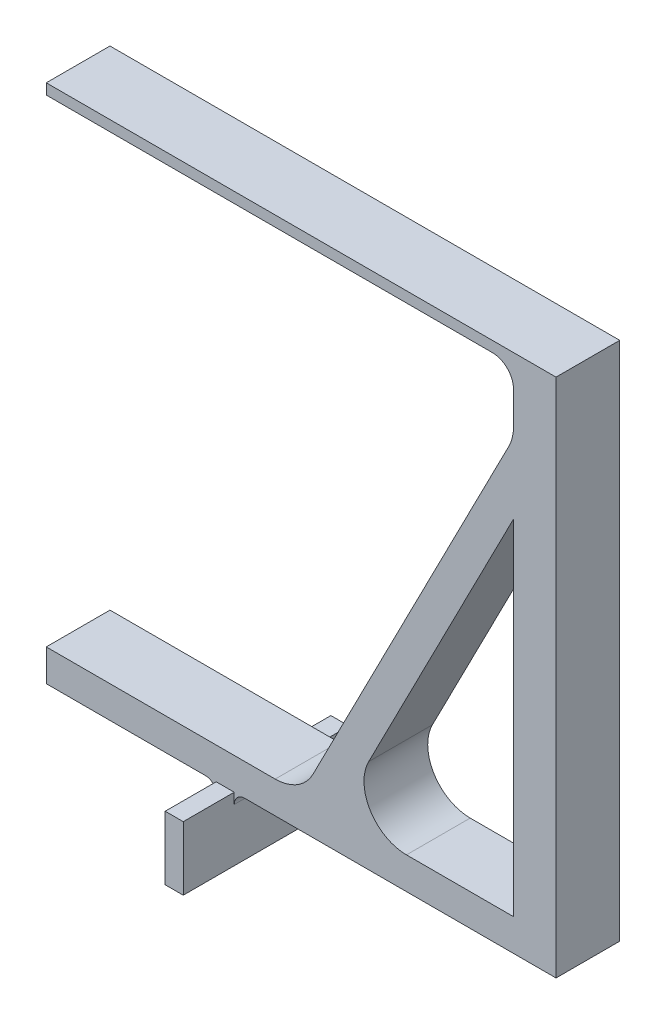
from build123d import *

# Parameters (mm, degrees)
BOSS_EXTRUDE1_DEPTH      = 3
FILLET1_R                = 2
FILLET2_R                = 1
BOSS_EXTRUDE2_DEPTH      = 2.4
BOSS_EXTRUDE2_DEPTH_BACK = 5.4
SKETCH2_W                = 0.85
SKETCH2_H                = 3
FILLET3_R                = 0.5
SKETCH3_W                = 3
SKETCH3_H                = 1.5
BOSS_EXTRUDE3_DEPTH      = 4


with BuildPart() as part:
    # Sketch1 → Boss-Extrude1 (new body)
    with BuildSketch(Plane.XY):
        Polygon((0, 3), (0, 0), (0.85, 0), (0.85, 3), (16, 3), (16, 27.5), (14, 27.5), (-8, 27.5), (-8, 27), (14, 27), (14, 24), (4, 4.5), (-4, 4.5), (-4, 3), align=None)
        Polygon((14, 4.5), (14, 20.71280895), (5.685739, 4.5), align=None, mode=Mode.SUBTRACT)
    extrude(amount=BOSS_EXTRUDE1_DEPTH)

    # Fillet1
    fillet1_edges = [part.edges().sort_by_distance(p)[0] for p in [
        (4, 4.5, 1.5),
        (14, 24, 1.5),
        (5.685739, 4.5, 1.5),
    ]]
    fillet(fillet1_edges, radius=FILLET1_R)

    # Fillet2
    fillet2_edges = [part.edges().sort_by_distance(p)[0] for p in [
        (14, 27, 1.5),
    ]]
    fillet(fillet2_edges, radius=FILLET2_R)

    # Sketch2 → Boss-Extrude2 (add, two sides: drawn at the far end of the back side and taken through both)
    with BuildSketch(Plane.XY.offset(3).offset(-BOSS_EXTRUDE2_DEPTH_BACK)):
        with Locations((0.425, 1.5)):
            Rectangle(SKETCH2_W, SKETCH2_H)
    extrude(amount=BOSS_EXTRUDE2_DEPTH + BOSS_EXTRUDE2_DEPTH_BACK)

    # Fillet3
    fillet3_edges = [part.edges().sort_by_distance(p)[0] for p in [
        (0, 3, 1.5),
        (0.85, 3, 1.5),
    ]]
    fillet(fillet3_edges, radius=FILLET3_R)

    # Sketch3 → Boss-Extrude3 (add)
    with BuildSketch(Plane.ZY.offset(4)):
        with Locations((1.5, 3.75)):
            Rectangle(SKETCH3_W, SKETCH3_H)
    extrude(amount=BOSS_EXTRUDE3_DEPTH)


solid = part.part
